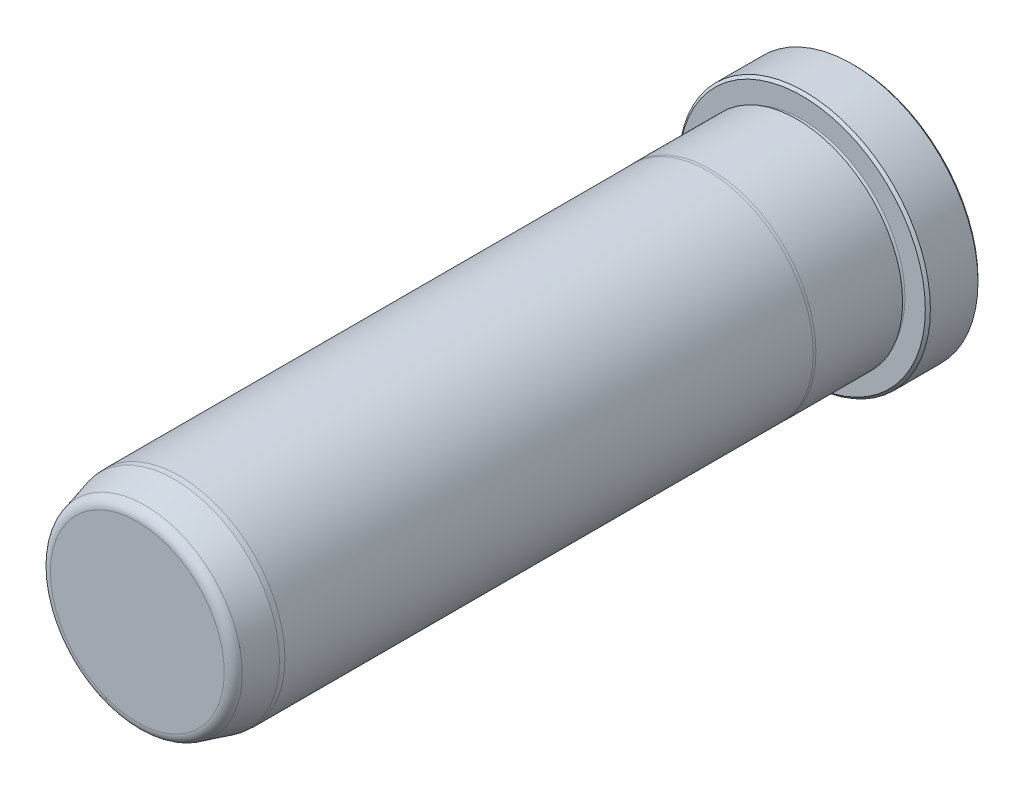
from build123d import *

# Parameters (mm, degrees)
FILLET6_R     = 1.5875
CHAMFER1_SIZE = 0.381


with BuildPart() as part:
    # Sketch1 → Revolve1 (revolve)
    with BuildSketch(Plane(origin=(0, 0, 0), x_dir=(0, 0, -1), z_dir=(1, 0, 0)), mode=Mode.PRIVATE) as revolve1_sk:
        with BuildLine():
            Line((0, 0), (0, 18.923))
            Line((0, 18.923), (-7.9248, 18.923))
            Line((-7.9248, 18.923), (-7.9248, 15.4813))
            ThreePointArc((-7.9248, 15.4813), (-8.3058, 15.1003), (-8.6868, 15.4813))
            Line((-8.6868, 15.4813), (-8.6868, 15.8877))
            Line((-8.6868, 15.8877), (-21.734763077, 15.8877))
            Line((-21.734763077, 15.8877), (-22.098, 15.8623))
            Line((-22.098, 15.8623), (-101.6, 15.8623))
            Line((-101.6, 15.8623), (-102.362, 15.795633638))
            Line((-102.362, 15.795633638), (-107.95, 14.298333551))
            Line((-107.95, 14.298333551), (-107.95, 0))
            Line((-107.95, 0), (0, 0))
        make_face()
    revolve(revolve1_sk.sketch.rotate(Axis((0, 0, 0), (0, 0, -1)), 90), axis=Axis((0, 0, 0), (0, 0, -1)))

    # Fillet6
    fillet6_edges = [part.edges().sort_by_distance(p)[0] for p in [
        (-14.298333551, 0, 107.95),
    ]]
    fillet(fillet6_edges, radius=FILLET6_R)

    # Chamfer1
    chamfer1_edges = [part.edges().sort_by_distance(p)[0] for p in [
        (-18.923, 0, 7.9248),
        (-18.923, 0, 0),
    ]]
    chamfer(chamfer1_edges, length=CHAMFER1_SIZE)


solid = part.part
